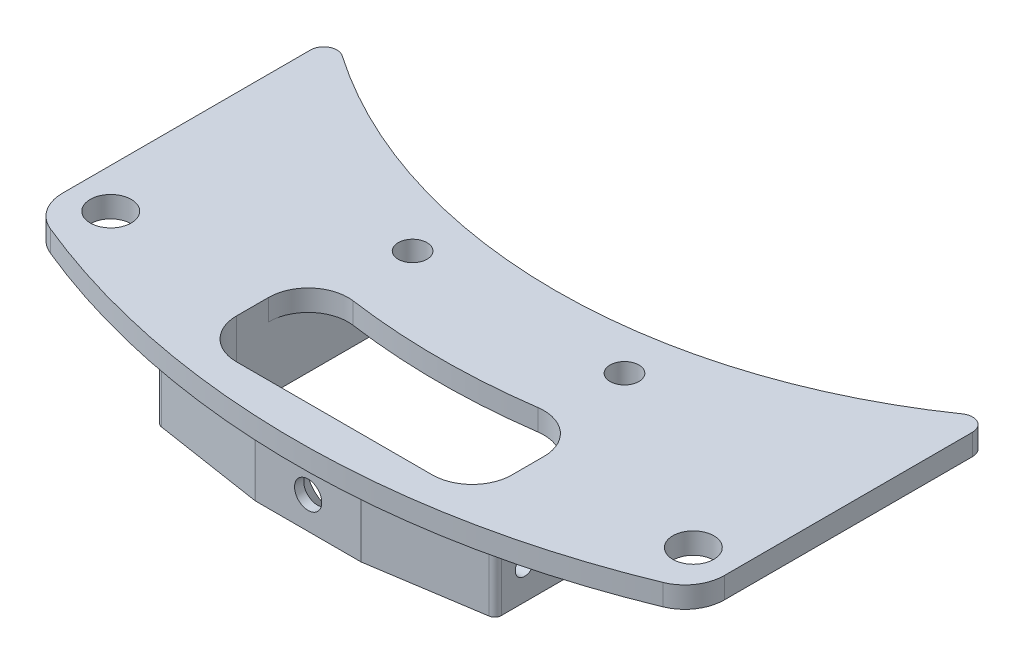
from build123d import *

# Parameters (mm, degrees)
BOSS_EXTRUDE1_DEPTH                            = 2.54
BOSS_EXTRUDE2_START                            = 7.619999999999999
BOSS_EXTRUDE2_DEPTH                            = 7.619999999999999
FILLET1_R                                      = 1.5875
F_10_0_1935_DIAMETER_HOLE1_D                   = 4.9149
F_8_32_TAPPED_HOLE1_D                          = 3.4544
F_4_40_TAPPED_HOLE1_D                          = 2.2606
CSK_FOR_4_FLAT_HEAD_MACHINE_SCREW1_D           = 3.2639
CSK_FOR_4_FLAT_HEAD_MACHINE_SCREW1_CSINK_D     = 6.8189856
CSK_FOR_4_FLAT_HEAD_MACHINE_SCREW1_CSINK_ANGLE = 82


with BuildPart() as part:
    # Sketch1 → Boss-Extrude1 (new body)
    with BuildSketch(Plane(origin=(0, 0, 0), x_dir=(1, 0, 0), z_dir=(0, 1, 0))):
        with BuildLine():
            Line((-39.68749996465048, -84.8509468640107), (-39.68749996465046, -51.98765595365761))
            ThreePointArc((-39.68749996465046, -51.98765595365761), (4e-15, -65.40500000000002), (39.68749996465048, -51.9876559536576))
            Line((39.68749996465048, -51.9876559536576), (39.68749996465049, -84.85094686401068))
            ThreePointArc((39.68749996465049, -84.85094686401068), (38.881922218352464, -87.5012624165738), (36.7377162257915, -89.25497524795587))
            ThreePointArc((36.7377162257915, -89.25497524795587), (5.91e-15, -96.52), (-36.73771622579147, -89.25497524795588))
            ThreePointArc((-36.73771622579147, -89.25497524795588), (-38.88192221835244, -87.50126241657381), (-39.68749996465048, -84.8509468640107))
        make_face()
        with BuildLine():
            Line((-16.509999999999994, -83.31335517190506), (-16.509999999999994, -87.15938847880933))
            ThreePointArc((-16.509999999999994, -87.15938847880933), (-15.115096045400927, -90.52698452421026), (-11.74749999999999, -91.92188847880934))
            Line((-11.74749999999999, -91.92188847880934), (11.747500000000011, -91.92188847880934))
            ThreePointArc((11.747500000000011, -91.92188847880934), (15.115096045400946, -90.52698452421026), (16.510000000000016, -87.15938847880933))
            Line((16.510000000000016, -87.15938847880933), (16.510000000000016, -83.31335517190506))
            ThreePointArc((16.510000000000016, -83.31335517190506), (14.871165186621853, -79.71834167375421), (11.082547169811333, -78.59750487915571))
            ThreePointArc((11.082547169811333, -78.59750487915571), (4.86e-15, -79.37499999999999), (-11.082547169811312, -78.59750487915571))
            ThreePointArc((-11.082547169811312, -78.59750487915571), (-14.87116518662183, -79.71834167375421), (-16.509999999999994, -83.31335517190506))
        make_face(mode=Mode.SUBTRACT)
    extrude(amount=BOSS_EXTRUDE1_DEPTH)

    # Sketch2 → Boss-Extrude2 (add)
    with BuildSketch(Plane.XZ.offset(BOSS_EXTRUDE2_START)):
        with BuildLine():
            Line((-11.747500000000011, 91.92188847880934), (11.747500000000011, 91.92188847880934))
            ThreePointArc((11.747500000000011, 91.92188847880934), (15.115096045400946, 90.52698452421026), (16.510000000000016, 87.15938847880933))
            Line((16.510000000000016, 87.15938847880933), (16.510000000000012, 63.28691748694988))
            ThreePointArc((16.510000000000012, 63.28691748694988), (18.423490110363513, 62.756585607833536), (20.32000000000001, 62.16841340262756))
            Line((20.32000000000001, 62.16841340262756), (20.320000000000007, 92.23587230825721))
            ThreePointArc((20.320000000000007, 92.23587230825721), (20.128855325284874, 92.75250165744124), (19.647481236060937, 93.0203097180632))
            Line((19.647481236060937, 93.0203097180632), (6.410257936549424, 95.06606240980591))
            ThreePointArc((6.410257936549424, 95.06606240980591), (6.349820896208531, 95.073043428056), (6.2890267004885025, 95.07537499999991))
            Line((6.2890267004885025, 95.07537499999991), (-6.289026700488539, 95.07537499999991))
            ThreePointArc((-6.289026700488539, 95.07537499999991), (-6.34982089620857, 95.07304342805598), (-6.410257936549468, 95.06606240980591))
            Line((-6.410257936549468, 95.06606240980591), (-19.647481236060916, 93.0203097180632))
            ThreePointArc((-19.647481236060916, 93.0203097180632), (-20.12885532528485, 92.75250165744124), (-20.319999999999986, 92.23587230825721))
            Line((-20.319999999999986, 92.23587230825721), (-20.320000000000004, 62.16841340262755))
            ThreePointArc((-20.320000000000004, 62.16841340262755), (-18.423490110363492, 62.75658560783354), (-16.509999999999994, 63.28691748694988))
            Line((-16.509999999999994, 63.28691748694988), (-16.510000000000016, 87.15938847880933))
            ThreePointArc((-16.510000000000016, 87.15938847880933), (-15.115096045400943, 90.52698452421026), (-11.747500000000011, 91.92188847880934))
        make_face()
    extrude(amount=-BOSS_EXTRUDE2_DEPTH)

    # Fillet1
    fillet1_edges = [part.edges().sort_by_distance(p)[0] for p in [
        (39.68749996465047, 1.27, 51.98765595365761),
        (-39.68749996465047, 1.27, 51.98765595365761),
        (-20.320000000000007, -3.8099999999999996, 62.168413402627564),
        (-16.509999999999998, -3.8099999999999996, 63.28691748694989),
        (16.510000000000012, -3.8099999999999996, 63.28691748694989),
        (20.320000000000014, -3.8099999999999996, 62.168413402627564),
    ]]
    fillet(fillet1_edges, radius=FILLET1_R)

    # 10 _0.1935_ Diameter Hole1 (through all)
    with Locations(Plane(origin=(0, 0, 0), x_dir=(-1, 0, 0), z_dir=(0, -1, 0))):
        with Locations((-34.925, -83.819999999), (34.925000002, -83.820000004)):
            Hole(F_10_0_1935_DIAMETER_HOLE1_D / 2)

    # 8-32 Tapped Hole1 (through all)
    with Locations(Plane(origin=(0, 0, 0), x_dir=(-1, 0, 0), z_dir=(0, -1, 0))):
        with Locations((-12.7, -69.85), (12.7, -69.85)):
            Hole(F_8_32_TAPPED_HOLE1_D / 2)

    # 4-40 Tapped Hole1 (through all)
    with Locations(Plane.ZY.offset(20.32000000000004)):
        with Locations((89.434631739, -3.81)):
            Hole(F_4_40_TAPPED_HOLE1_D / 2)

    # CSK for _4 Flat Head Machine Screw1 (through all)
    with Locations(Plane(origin=(0, 0, 91.92188847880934), x_dir=(-1, 0, 0), z_dir=(0, 0, -1))):
        with Locations((0, -3.81)):
            CounterSinkHole(CSK_FOR_4_FLAT_HEAD_MACHINE_SCREW1_D / 2, CSK_FOR_4_FLAT_HEAD_MACHINE_SCREW1_CSINK_D / 2, counter_sink_angle=CSK_FOR_4_FLAT_HEAD_MACHINE_SCREW1_CSINK_ANGLE)


solid = part.part
